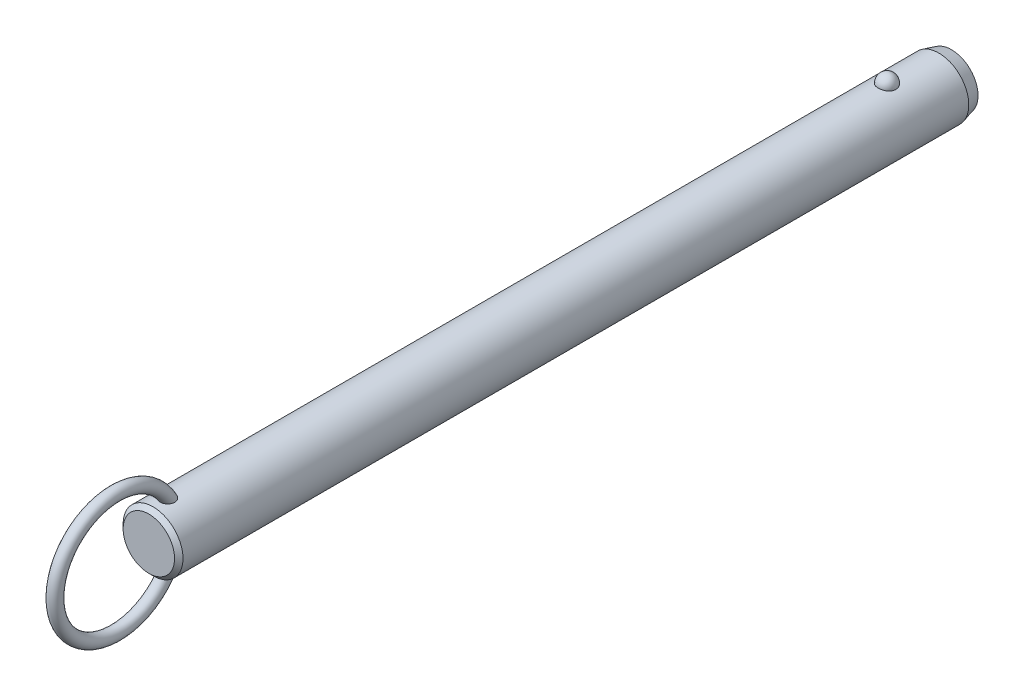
ISO-10303-21;
HEADER;
FILE_DESCRIPTION(('STEP AP214'),'2;1');
FILE_NAME('part.step','',(''),(''),'','','');
FILE_SCHEMA(('AUTOMOTIVE_DESIGN { 1 0 10303 214 1 1 1 1 }'));
ENDSEC;
DATA;
#1=APPLICATION_CONTEXT('core data for automotive mechanical design processes');
#2=APPLICATION_PROTOCOL_DEFINITION('international standard','automotive_design',2000,#1);
#3=PRODUCT_CONTEXT('',#1,'mechanical');
#4=PRODUCT('Part','Part','',(#3));
#5=PRODUCT_RELATED_PRODUCT_CATEGORY('part','',(#4));
#6=PRODUCT_DEFINITION_FORMATION('','',#4);
#7=PRODUCT_DEFINITION_CONTEXT('part definition',#1,'design');
#8=PRODUCT_DEFINITION('design','',#6,#7);
#9=PRODUCT_DEFINITION_SHAPE('','',#8);
#10=(LENGTH_UNIT() NAMED_UNIT(*) SI_UNIT(.MILLI.,.METRE.));
#11=(NAMED_UNIT(*) PLANE_ANGLE_UNIT() SI_UNIT($,.RADIAN.));
#12=(NAMED_UNIT(*) SI_UNIT($,.STERADIAN.) SOLID_ANGLE_UNIT());
#13=UNCERTAINTY_MEASURE_WITH_UNIT(LENGTH_MEASURE(1.E-05),#10,'distance_accuracy_value','');
#14=(GEOMETRIC_REPRESENTATION_CONTEXT(3) GLOBAL_UNCERTAINTY_ASSIGNED_CONTEXT((#13)) GLOBAL_UNIT_ASSIGNED_CONTEXT((#10,
#11,#12)) REPRESENTATION_CONTEXT('',''));
#15=CARTESIAN_POINT('',(0.,0.,0.));
#16=DIRECTION('',(0.,0.,1.));
#17=DIRECTION('',(1.,0.,0.));
#18=AXIS2_PLACEMENT_3D('',#15,#16,#17);
#19=CARTESIAN_POINT('',(0.,0.,165.1));
#20=DIRECTION('',(0.,0.,-1.));
#21=DIRECTION('',(-1.,0.,0.));
#22=AXIS2_PLACEMENT_3D('',#19,#20,#21);
#23=CYLINDRICAL_SURFACE('',#22,7.1);
#24=CARTESIAN_POINT('',(2.0769088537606,6.78943661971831,-2.1));
#25=CARTESIAN_POINT('',(2.07690739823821,6.78943796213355,-1.98268154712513));
#26=CARTESIAN_POINT('',(2.06738130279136,6.79237331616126,-1.86534506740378));
#27=CARTESIAN_POINT('',(2.0295040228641,6.8037853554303,-1.63400788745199));
#28=CARTESIAN_POINT('',(2.00114757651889,6.81226358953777,-1.52000812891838));
#29=CARTESIAN_POINT('',(1.92632025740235,6.83379798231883,-1.29863433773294));
#30=CARTESIAN_POINT('',(1.87985726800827,6.84685214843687,-1.19125744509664));
#31=CARTESIAN_POINT('',(1.76995205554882,6.87608091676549,-0.98604657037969));
#32=CARTESIAN_POINT('',(1.70650980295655,6.8922555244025,-0.88821260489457));
#33=CARTESIAN_POINT('',(1.5638119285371,6.92602930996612,-0.704242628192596));
#34=CARTESIAN_POINT('',(1.4844714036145,6.94363582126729,-0.618173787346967));
#35=CARTESIAN_POINT('',(1.31221746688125,6.97823658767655,-0.460740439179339));
#36=CARTESIAN_POINT('',(1.21930409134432,6.99523084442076,-0.389375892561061));
#37=CARTESIAN_POINT('',(1.02268781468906,7.02666176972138,-0.263547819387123));
#38=CARTESIAN_POINT('',(0.91902009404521,7.04110638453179,-0.209031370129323));
#39=CARTESIAN_POINT('',(0.703548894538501,7.06588726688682,-0.118163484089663));
#40=CARTESIAN_POINT('',(0.591746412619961,7.07622403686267,-0.0818098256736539));
#41=CARTESIAN_POINT('',(0.365557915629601,7.09147068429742,-0.0288711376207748));
#42=CARTESIAN_POINT('',(0.251267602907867,7.09648447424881,-0.0119070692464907));
#43=CARTESIAN_POINT('',(0.0213499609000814,7.10089837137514,0.00304925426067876));
#44=CARTESIAN_POINT('',(-0.0942772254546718,7.10029907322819,0.00104351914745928));
#45=CARTESIAN_POINT('',(-0.321651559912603,7.09360829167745,-0.0216931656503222));
#46=CARTESIAN_POINT('',(-0.433431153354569,7.08760388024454,-0.0421272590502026));
#47=CARTESIAN_POINT('',(-0.651862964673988,7.07086131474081,-0.100729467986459));
#48=CARTESIAN_POINT('',(-0.758515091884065,7.06012307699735,-0.138897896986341));
#49=CARTESIAN_POINT('',(-0.964449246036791,7.03496097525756,-0.232213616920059));
#50=CARTESIAN_POINT('',(-1.06368095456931,7.02051445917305,-0.287465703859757));
#51=CARTESIAN_POINT('',(-1.25145353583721,6.98948740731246,-0.413383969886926));
#52=CARTESIAN_POINT('',(-1.33999321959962,6.97290663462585,-0.48405186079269));
#53=CARTESIAN_POINT('',(-1.50591604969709,6.93898770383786,-0.640594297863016));
#54=CARTESIAN_POINT('',(-1.58302488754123,6.92164094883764,-0.726757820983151));
#55=CARTESIAN_POINT('',(-1.72189320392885,6.8884103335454,-0.91092752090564));
#56=CARTESIAN_POINT('',(-1.78365144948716,6.87252659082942,-1.008934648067));
#57=CARTESIAN_POINT('',(-1.89101272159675,6.84377189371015,-1.21549497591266));
#58=CARTESIAN_POINT('',(-1.93639553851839,6.83094274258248,-1.32416860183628));
#59=CARTESIAN_POINT('',(-2.00874275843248,6.81002070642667,-1.54791500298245));
#60=CARTESIAN_POINT('',(-2.03570774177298,6.80192767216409,-1.66298757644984));
#61=CARTESIAN_POINT('',(-2.07047276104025,6.7914266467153,-1.89571453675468));
#62=CARTESIAN_POINT('',(-2.07835878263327,6.78899315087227,-2.01335491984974));
#63=CARTESIAN_POINT('',(-2.07502083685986,6.79001409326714,-2.24833570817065));
#64=CARTESIAN_POINT('',(-2.06379746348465,6.7934683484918,-2.36567612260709));
#65=CARTESIAN_POINT('',(-2.02263913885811,6.80583442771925,-2.59603194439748));
#66=CARTESIAN_POINT('',(-1.99281127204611,6.81471501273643,-2.70906820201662));
#67=CARTESIAN_POINT('',(-1.91526639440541,6.83691232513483,-2.92836575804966));
#68=CARTESIAN_POINT('',(-1.8675486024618,6.85022924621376,-3.03462676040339));
#69=CARTESIAN_POINT('',(-1.75504492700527,6.87991336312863,-3.23806487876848));
#70=CARTESIAN_POINT('',(-1.69015924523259,6.89629822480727,-3.33518422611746));
#71=CARTESIAN_POINT('',(-1.54505404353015,6.93024852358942,-3.51697105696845));
#72=CARTESIAN_POINT('',(-1.46483385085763,6.94781401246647,-3.60163799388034));
#73=CARTESIAN_POINT('',(-1.29071406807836,6.98225977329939,-3.75654119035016));
#74=CARTESIAN_POINT('',(-1.19675650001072,6.99913673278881,-3.82671308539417));
#75=CARTESIAN_POINT('',(-0.997940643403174,7.03023618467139,-3.9501837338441));
#76=CARTESIAN_POINT('',(-0.89308318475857,7.04445887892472,-4.00348377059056));
#77=CARTESIAN_POINT('',(-0.676902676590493,7.06848365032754,-4.09107242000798));
#78=CARTESIAN_POINT('',(-0.565686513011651,7.0783430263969,-4.12560889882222));
#79=CARTESIAN_POINT('',(-0.338739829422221,7.09282534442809,-4.17575450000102));
#80=CARTESIAN_POINT('',(-0.223009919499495,7.09744899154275,-4.19136617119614));
#81=CARTESIAN_POINT('',(0.00707628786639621,7.10090930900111,-4.20307965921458));
#82=CARTESIAN_POINT('',(0.121410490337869,7.09986531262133,-4.19958377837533));
#83=CARTESIAN_POINT('',(0.347815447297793,7.092380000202,-4.17411564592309));
#84=CARTESIAN_POINT('',(0.459886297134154,7.08593891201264,-4.15214417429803));
#85=CARTESIAN_POINT('',(0.678084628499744,7.06838983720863,-4.09049562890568));
#86=CARTESIAN_POINT('',(0.784237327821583,7.05730369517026,-4.05090137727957));
#87=CARTESIAN_POINT('',(0.988305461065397,7.03163139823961,-3.95511447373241));
#88=CARTESIAN_POINT('',(1.08622031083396,7.01704499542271,-3.89892064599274));
#89=CARTESIAN_POINT('',(1.27284490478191,6.98562668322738,-3.77035541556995));
#90=CARTESIAN_POINT('',(1.36137372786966,6.96876135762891,-3.69772964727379));
#91=CARTESIAN_POINT('',(1.52509486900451,6.93477412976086,-3.53878279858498));
#92=CARTESIAN_POINT('',(1.60028496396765,6.91765218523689,-3.45245943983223));
#93=CARTESIAN_POINT('',(1.73681688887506,6.88465753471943,-3.26658774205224));
#94=CARTESIAN_POINT('',(1.79785966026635,6.86881574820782,-3.16681408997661));
#95=CARTESIAN_POINT('',(1.90265327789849,6.84053157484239,-2.95814408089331));
#96=CARTESIAN_POINT('',(1.94640861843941,6.82808830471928,-2.84925010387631));
#97=CARTESIAN_POINT('',(2.01274378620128,6.80881460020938,-2.63454318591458));
#98=CARTESIAN_POINT('',(2.03676193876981,6.80160856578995,-2.52920574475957));
#99=CARTESIAN_POINT('',(2.06884490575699,6.79191902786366,-2.3159172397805));
#100=CARTESIAN_POINT('',(2.07691019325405,6.78943538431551,-2.20796625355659));
#101=CARTESIAN_POINT('',(2.0769088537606,6.78943661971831,-2.1));
#102=B_SPLINE_CURVE_WITH_KNOTS('',3,(#24,#25,#26,#27,#28,#29,#30,#31,#32,#33,#34,#35,#36,#37,
#38,#39,#40,#41,#42,#43,#44,#45,#46,#47,#48,#49,#50,#51,#52,#53,#54,#55,#56,#57,#58,#59,#60,#61,
#62,#63,#64,#65,#66,#67,#68,#69,#70,#71,#72,#73,#74,#75,#76,#77,#78,#79,#80,#81,#82,#83,#84,#85,
#86,#87,#88,#89,#90,#91,#92,#93,#94,#95,#96,#97,#98,#99,#100,#101),.UNSPECIFIED.,.T.,.F.,(4,2,2,
2,2,2,2,2,2,2,2,2,2,2,2,2,2,2,2,2,2,2,2,2,2,2,2,2,2,2,2,2,2,2,2,2,2,2,4),(0.,0.351568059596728,
0.703234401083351,1.05474780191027,1.40626181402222,1.75970563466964,2.11314851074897,
2.4654696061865,2.81774759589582,3.16301449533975,3.50824481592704,3.84801136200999,
4.18778391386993,4.52968352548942,4.87162112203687,5.22076181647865,5.56993054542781,
5.92363364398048,6.27732559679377,6.62942052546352,6.98150450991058,7.33158042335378,
7.68167162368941,8.03384443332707,8.38603269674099,8.73975272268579,9.09344583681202,
9.44234545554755,9.79119807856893,10.1327344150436,10.4742563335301,10.8141898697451,
11.1541474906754,11.4997793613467,11.8454687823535,12.1979079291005,12.5502553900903,
12.8738073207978,13.1973496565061),.UNSPECIFIED.);
#103=CARTESIAN_POINT('',(2.0769088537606,6.78943661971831,-2.1));
#104=VERTEX_POINT('',#103);
#105=EDGE_CURVE('E41',#104,#104,#102,.T.);
#106=ORIENTED_EDGE('',*,*,#105,.T.);
#107=EDGE_LOOP('',(#106));
#108=FACE_BOUND('',#107,.T.);
#109=CARTESIAN_POINT('',(0.,0.,172.02));
#110=DIRECTION('',(0.,0.,1.));
#111=DIRECTION('',(1.,0.,0.));
#112=AXIS2_PLACEMENT_3D('',#109,#110,#111);
#113=CIRCLE('',#112,7.1);
#114=CARTESIAN_POINT('',(7.1,0.,172.02));
#115=VERTEX_POINT('',#114);
#116=EDGE_CURVE('E10',#115,#115,#113,.F.);
#117=ORIENTED_EDGE('',*,*,#116,.T.);
#118=EDGE_LOOP('',(#117));
#119=FACE_BOUND('',#118,.T.);
#120=CARTESIAN_POINT('',(-0.429539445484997,-7.08699541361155,166.842921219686));
#121=CARTESIAN_POINT('',(-0.508331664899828,-7.08221999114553,166.866876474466));
#122=CARTESIAN_POINT('',(-0.585039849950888,-7.07624016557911,166.897457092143));
#123=CARTESIAN_POINT('',(-0.73208265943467,-7.06254296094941,166.971024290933));
#124=CARTESIAN_POINT('',(-0.802417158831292,-7.05482554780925,167.014011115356));
#125=CARTESIAN_POINT('',(-0.934722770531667,-7.03851844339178,167.111113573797));
#126=CARTESIAN_POINT('',(-0.996700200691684,-7.02992941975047,167.165220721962));
#127=CARTESIAN_POINT('',(-1.11079942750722,-7.01280697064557,167.282967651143));
#128=CARTESIAN_POINT('',(-1.16292136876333,-7.00427354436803,167.346607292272));
#129=CARTESIAN_POINT('',(-1.25705660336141,-6.98799959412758,167.482687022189));
#130=CARTESIAN_POINT('',(-1.29888032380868,-6.98027525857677,167.555259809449));
#131=CARTESIAN_POINT('',(-1.37069920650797,-6.96652886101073,167.706168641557));
#132=CARTESIAN_POINT('',(-1.40069157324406,-6.96050720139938,167.784506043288));
#133=CARTESIAN_POINT('',(-1.45043507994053,-6.95031881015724,167.950190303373));
#134=CARTESIAN_POINT('',(-1.46937115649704,-6.94630231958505,168.037789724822));
#135=CARTESIAN_POINT('',(-1.49424917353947,-6.94099239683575,168.214871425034));
#136=CARTESIAN_POINT('',(-1.50018601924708,-6.93970003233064,168.304354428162));
#137=CARTESIAN_POINT('',(-1.49978214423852,-6.93978815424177,168.494060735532));
#138=CARTESIAN_POINT('',(-1.49187639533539,-6.94150934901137,168.594279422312));
#139=CARTESIAN_POINT('',(-1.46177925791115,-6.94790814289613,168.792479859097));
#140=CARTESIAN_POINT('',(-1.43957541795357,-6.95258831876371,168.890459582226));
#141=CARTESIAN_POINT('',(-1.37783293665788,-6.96510647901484,169.09536292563));
#142=CARTESIAN_POINT('',(-1.33634073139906,-6.97328848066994,169.201680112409));
#143=CARTESIAN_POINT('',(-1.23686994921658,-6.99161706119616,169.406177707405));
#144=CARTESIAN_POINT('',(-1.17889192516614,-7.00176357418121,169.504358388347));
#145=CARTESIAN_POINT('',(-1.05875124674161,-7.02082898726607,169.672374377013));
#146=CARTESIAN_POINT('',(-0.999247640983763,-7.02963746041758,169.744123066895));
#147=CARTESIAN_POINT('',(-0.869494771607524,-7.04686074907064,169.877195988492));
#148=CARTESIAN_POINT('',(-0.799263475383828,-7.05527619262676,169.938537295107));
#149=CARTESIAN_POINT('',(-0.665408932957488,-7.06899457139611,170.035131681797));
#150=CARTESIAN_POINT('',(-0.603817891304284,-7.07457275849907,170.073151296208));
#151=CARTESIAN_POINT('',(-0.475172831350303,-7.08437420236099,170.138758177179));
#152=CARTESIAN_POINT('',(-0.408123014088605,-7.08859848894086,170.166353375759));
#153=CARTESIAN_POINT('',(-0.269431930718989,-7.09522749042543,170.209256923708));
#154=CARTESIAN_POINT('',(-0.197757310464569,-7.09761688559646,170.224461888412));
#155=CARTESIAN_POINT('',(-0.0527849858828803,-7.10017268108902,170.240716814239));
#156=CARTESIAN_POINT('',(0.0205115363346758,-7.10034065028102,170.241776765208));
#157=CARTESIAN_POINT('',(0.156426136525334,-7.09855986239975,170.230461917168));
#158=CARTESIAN_POINT('',(0.219199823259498,-7.09688191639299,170.219806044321));
#159=CARTESIAN_POINT('',(0.342134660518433,-7.09201880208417,170.188537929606));
#160=CARTESIAN_POINT('',(0.402295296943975,-7.08883333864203,170.167923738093));
#161=CARTESIAN_POINT('',(0.520687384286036,-7.08113868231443,170.117212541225));
#162=CARTESIAN_POINT('',(0.578791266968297,-7.07658958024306,170.086827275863));
#163=CARTESIAN_POINT('',(0.690173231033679,-7.06659708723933,170.018367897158));
#164=CARTESIAN_POINT('',(0.743447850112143,-7.061153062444,169.980288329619));
#165=CARTESIAN_POINT('',(0.870947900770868,-7.04680292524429,169.876592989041));
#166=CARTESIAN_POINT('',(0.941828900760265,-7.03755800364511,169.806897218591));
#167=CARTESIAN_POINT('',(1.07136606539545,-7.01900793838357,169.656945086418));
#168=CARTESIAN_POINT('',(1.13000013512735,-7.00970271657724,169.576670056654));
#169=CARTESIAN_POINT('',(1.23579584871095,-6.99183327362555,169.406899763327));
#170=CARTESIAN_POINT('',(1.28274271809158,-6.98328455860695,169.317269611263));
#171=CARTESIAN_POINT('',(1.36351442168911,-6.96796352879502,169.132176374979));
#172=CARTESIAN_POINT('',(1.39733971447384,-6.96119115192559,169.036713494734));
#173=CARTESIAN_POINT('',(1.45579181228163,-6.94922464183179,168.82530928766));
#174=CARTESIAN_POINT('',(1.47790145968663,-6.94449000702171,168.708631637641));
#175=CARTESIAN_POINT('',(1.50168752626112,-6.93938731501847,168.473015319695));
#176=CARTESIAN_POINT('',(1.50336085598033,-6.93901991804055,168.35407631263));
#177=CARTESIAN_POINT('',(1.48486516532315,-6.9430010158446,168.12360799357));
#178=CARTESIAN_POINT('',(1.46573441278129,-6.9471253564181,168.011995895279));
#179=CARTESIAN_POINT('',(1.40606892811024,-6.95944667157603,167.794886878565));
#180=CARTESIAN_POINT('',(1.36556446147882,-6.96763788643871,167.6893815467));
#181=CARTESIAN_POINT('',(1.2708270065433,-6.98548038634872,167.504287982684));
#182=CARTESIAN_POINT('',(1.21949810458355,-6.99473841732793,167.423171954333));
#183=CARTESIAN_POINT('',(1.10242050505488,-7.01414069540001,167.272227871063));
#184=CARTESIAN_POINT('',(1.03668119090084,-7.02428436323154,167.20239252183));
#185=CARTESIAN_POINT('',(0.900559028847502,-7.04295285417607,167.083573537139));
#186=CARTESIAN_POINT('',(0.831428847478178,-7.05153466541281,167.033157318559));
#187=CARTESIAN_POINT('',(0.685291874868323,-7.06723150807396,166.945142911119));
#188=CARTESIAN_POINT('',(0.608287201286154,-7.07434693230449,166.907541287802));
#189=CARTESIAN_POINT('',(0.451878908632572,-7.08602232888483,166.847491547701));
#190=CARTESIAN_POINT('',(0.372686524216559,-7.09067127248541,166.824508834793));
#191=CARTESIAN_POINT('',(0.21147739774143,-7.09730788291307,166.792035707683));
#192=CARTESIAN_POINT('',(0.129460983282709,-7.09929585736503,166.78254373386));
#193=CARTESIAN_POINT('',(-0.0332905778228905,-7.10037858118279,166.777351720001));
#194=CARTESIAN_POINT('',(-0.114016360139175,-7.09953334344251,166.781365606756));
#195=CARTESIAN_POINT('',(-0.273670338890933,-7.09517338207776,166.802454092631));
#196=CARTESIAN_POINT('',(-0.352598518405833,-7.09165863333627,166.819528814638));
#197=CARTESIAN_POINT('',(-0.429539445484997,-7.08699541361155,166.842921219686));
#198=B_SPLINE_CURVE_WITH_KNOTS('',3,(#120,#121,#122,#123,#124,#125,#126,#127,#128,#129,#130,
#131,#132,#133,#134,#135,#136,#137,#138,#139,#140,#141,#142,#143,#144,#145,#146,#147,#148,#149,
#150,#151,#152,#153,#154,#155,#156,#157,#158,#159,#160,#161,#162,#163,#164,#165,#166,#167,#168,
#169,#170,#171,#172,#173,#174,#175,#176,#177,#178,#179,#180,#181,#182,#183,#184,#185,#186,#187,
#188,#189,#190,#191,#192,#193,#194,#195,#196,#197),.UNSPECIFIED.,.T.,.F.,(4,2,2,2,2,2,2,2,2,2,2,
2,2,2,2,2,2,2,2,2,2,2,2,2,2,2,2,2,2,2,2,2,2,2,2,2,2,2,4),(0.,0.247183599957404,
0.494372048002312,0.741372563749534,0.988369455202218,1.23962059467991,1.490931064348,
1.75897818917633,2.02713035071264,2.3275826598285,2.62829697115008,2.97008736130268,
3.31186629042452,3.59175319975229,3.87117637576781,4.08813841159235,4.30493502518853,
4.5235225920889,4.74195577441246,4.93215328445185,5.12238804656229,5.31884850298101,
5.51544871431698,5.81332317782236,6.11173048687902,6.41527266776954,6.71880423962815,
7.07358156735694,7.42841252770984,7.76631485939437,8.10373999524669,8.39142246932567,
8.67891817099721,8.93560332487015,9.19221962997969,9.43881106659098,9.68537399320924,
9.92674752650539,10.1681233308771),.UNSPECIFIED.);
#199=CARTESIAN_POINT('',(-0.429539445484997,-7.08699541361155,166.842921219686));
#200=VERTEX_POINT('',#199);
#201=EDGE_CURVE('E58',#200,#200,#198,.T.);
#202=ORIENTED_EDGE('',*,*,#201,.T.);
#203=EDGE_LOOP('',(#202));
#204=FACE_BOUND('',#203,.T.);
#205=CARTESIAN_POINT('',(-0.429539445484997,7.08699541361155,166.842921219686));
#206=CARTESIAN_POINT('',(-0.351665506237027,7.09171429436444,166.819246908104));
#207=CARTESIAN_POINT('',(-0.271733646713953,7.09525896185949,166.802036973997));
#208=CARTESIAN_POINT('',(-0.110026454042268,7.09960839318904,166.781005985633));
#209=CARTESIAN_POINT('',(-0.0282502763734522,7.10041187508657,166.777191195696));
#210=CARTESIAN_POINT('',(0.134782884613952,7.09918849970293,166.783059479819));
#211=CARTESIAN_POINT('',(0.216039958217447,7.09716214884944,166.79274013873));
#212=CARTESIAN_POINT('',(0.375730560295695,7.09050177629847,166.825347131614));
#213=CARTESIAN_POINT('',(0.454164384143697,7.08586802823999,166.848272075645));
#214=CARTESIAN_POINT('',(0.606025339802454,7.07449911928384,166.906771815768));
#215=CARTESIAN_POINT('',(0.67945100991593,7.06776334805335,166.942350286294));
#216=CARTESIAN_POINT('',(0.819234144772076,7.05292866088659,167.025175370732));
#217=CARTESIAN_POINT('',(0.88559181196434,7.04482978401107,167.072421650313));
#218=CARTESIAN_POINT('',(1.00993211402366,7.02808709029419,167.177590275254));
#219=CARTESIAN_POINT('',(1.06785399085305,7.01943990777,167.235583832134));
#220=CARTESIAN_POINT('',(1.17342527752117,7.00256662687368,167.360301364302));
#221=CARTESIAN_POINT('',(1.22107408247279,6.99434055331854,167.427025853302));
#222=CARTESIAN_POINT('',(1.30652927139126,6.97889183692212,167.569362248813));
#223=CARTESIAN_POINT('',(1.34399711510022,6.97170674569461,167.645180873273));
#224=CARTESIAN_POINT('',(1.40682616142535,6.95930080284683,167.801810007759));
#225=CARTESIAN_POINT('',(1.43218374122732,6.95408053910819,167.88262200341));
#226=CARTESIAN_POINT('',(1.47246409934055,6.94566853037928,168.053531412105));
#227=CARTESIAN_POINT('',(1.48642590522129,6.9426653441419,168.14386307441));
#228=CARTESIAN_POINT('',(1.5011410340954,6.93949744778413,168.325619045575));
#229=CARTESIAN_POINT('',(1.50188917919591,6.93933385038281,168.417043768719));
#230=CARTESIAN_POINT('',(1.49030464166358,6.94183245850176,168.61084381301));
#231=CARTESIAN_POINT('',(1.47627413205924,6.94486147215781,168.713112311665));
#232=CARTESIAN_POINT('',(1.43356351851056,6.95380194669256,168.914471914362));
#233=CARTESIAN_POINT('',(1.4048676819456,6.95971650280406,169.013559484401));
#234=CARTESIAN_POINT('',(1.32908750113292,6.97461208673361,169.218908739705));
#235=CARTESIAN_POINT('',(1.28011435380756,6.98388945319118,169.324456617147));
#236=CARTESIAN_POINT('',(1.16520357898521,7.00397743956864,169.525760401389));
#237=CARTESIAN_POINT('',(1.09927694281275,7.01478706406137,169.621522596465));
#238=CARTESIAN_POINT('',(0.969361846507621,7.03373936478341,169.776756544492));
#239=CARTESIAN_POINT('',(0.909042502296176,7.04187023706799,169.839303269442));
#240=CARTESIAN_POINT('',(0.779178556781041,7.05741732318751,169.954053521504));
#241=CARTESIAN_POINT('',(0.709649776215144,7.06483472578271,170.006274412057));
#242=CARTESIAN_POINT('',(0.576854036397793,7.0767751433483,170.088113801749));
#243=CARTESIAN_POINT('',(0.515118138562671,7.08158033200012,170.120164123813));
#244=CARTESIAN_POINT('',(0.387127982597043,7.08972701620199,170.173765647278));
#245=CARTESIAN_POINT('',(0.320877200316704,7.09306962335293,170.195324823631));
#246=CARTESIAN_POINT('',(0.185041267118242,7.09791507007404,170.226400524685));
#247=CARTESIAN_POINT('',(0.115437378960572,7.09940591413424,170.235838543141));
#248=CARTESIAN_POINT('',(-0.0243157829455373,7.10030171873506,170.241522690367));
#249=CARTESIAN_POINT('',(-0.0944648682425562,7.0997073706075,170.237773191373));
#250=CARTESIAN_POINT('',(-0.225713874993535,7.09668414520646,170.218508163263));
#251=CARTESIAN_POINT('',(-0.287006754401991,7.09444865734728,170.204232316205));
#252=CARTESIAN_POINT('',(-0.406555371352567,7.08860360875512,170.166368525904));
#253=CARTESIAN_POINT('',(-0.464809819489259,7.08499346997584,170.142776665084));
#254=CARTESIAN_POINT('',(-0.594955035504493,7.07541654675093,170.078923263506));
#255=CARTESIAN_POINT('',(-0.665389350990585,7.06906574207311,170.035753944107));
#256=CARTESIAN_POINT('',(-0.798242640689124,7.05530261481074,169.938587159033));
#257=CARTESIAN_POINT('',(-0.860645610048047,7.0478882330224,169.884568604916));
#258=CARTESIAN_POINT('',(-0.994249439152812,7.03045217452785,169.750996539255));
#259=CARTESIAN_POINT('',(-1.06260129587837,7.02030745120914,169.668614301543));
#260=CARTESIAN_POINT('',(-1.18502045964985,7.00068382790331,169.493843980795));
#261=CARTESIAN_POINT('',(-1.23907684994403,6.99120544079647,169.401448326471));
#262=CARTESIAN_POINT('',(-1.33335589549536,6.97384343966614,169.208008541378));
#263=CARTESIAN_POINT('',(-1.37336138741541,6.96598557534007,169.106856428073));
#264=CARTESIAN_POINT('',(-1.43770677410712,6.9529905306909,168.899504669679));
#265=CARTESIAN_POINT('',(-1.46204473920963,6.94785368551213,168.79330440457));
#266=CARTESIAN_POINT('',(-1.49537533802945,6.94076296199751,168.568231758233));
#267=CARTESIAN_POINT('',(-1.50273564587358,6.93914842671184,168.44909751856));
#268=CARTESIAN_POINT('',(-1.4954555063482,6.94072368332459,168.211470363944));
#269=CARTESIAN_POINT('',(-1.48082914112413,6.94391040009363,168.092977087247));
#270=CARTESIAN_POINT('',(-1.43076401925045,6.95438579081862,167.873432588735));
#271=CARTESIAN_POINT('',(-1.39762227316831,6.96121852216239,167.771841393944));
#272=CARTESIAN_POINT('',(-1.31211274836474,6.97783941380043,167.577351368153));
#273=CARTESIAN_POINT('',(-1.25976607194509,6.98762432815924,167.48444313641));
#274=CARTESIAN_POINT('',(-1.14583073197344,7.00713153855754,167.324160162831));
#275=CARTESIAN_POINT('',(-1.08665947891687,7.01665982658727,167.255035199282));
#276=CARTESIAN_POINT('',(-0.956606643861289,7.03556646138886,167.128878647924));
#277=CARTESIAN_POINT('',(-0.885737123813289,7.04494495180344,167.071834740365));
#278=CARTESIAN_POINT('',(-0.751558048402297,7.06035735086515,166.983100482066));
#279=CARTESIAN_POINT('',(-0.69012057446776,7.0666695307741,166.948593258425));
#280=CARTESIAN_POINT('',(-0.562815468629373,7.07794609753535,166.888750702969));
#281=CARTESIAN_POINT('',(-0.496948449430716,7.08291067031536,166.863414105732));
#282=CARTESIAN_POINT('',(-0.429539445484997,7.08699541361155,166.842921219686));
#283=B_SPLINE_CURVE_WITH_KNOTS('',3,(#205,#206,#207,#208,#209,#210,#211,#212,#213,#214,#215,
#216,#217,#218,#219,#220,#221,#222,#223,#224,#225,#226,#227,#228,#229,#230,#231,#232,#233,#234,
#235,#236,#237,#238,#239,#240,#241,#242,#243,#244,#245,#246,#247,#248,#249,#250,#251,#252,#253,
#254,#255,#256,#257,#258,#259,#260,#261,#262,#263,#264,#265,#266,#267,#268,#269,#270,#271,#272,
#273,#274,#275,#276,#277,#278,#279,#280,#281,#282),.UNSPECIFIED.,.T.,.F.,(4,2,2,2,2,2,2,2,2,2,2,
2,2,2,2,2,2,2,2,2,2,2,2,2,2,2,2,2,2,2,2,2,2,2,2,2,2,2,4),(0.,0.244335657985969,
0.488785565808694,0.733191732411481,0.977572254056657,1.2220237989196,1.46646834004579,
1.71259457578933,1.9587352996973,2.21226768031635,2.46587585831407,2.73913816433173,
3.01250754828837,3.32109936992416,3.63002293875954,3.9786351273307,4.32702187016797,
4.58793945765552,4.84841449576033,5.05676704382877,5.26496096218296,5.47449661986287,
5.68396281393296,5.87205447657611,6.06022532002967,6.30743751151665,6.55513496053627,
6.87602468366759,7.1971587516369,7.52305774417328,7.84899686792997,8.2051615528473,
8.56109821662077,8.88040084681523,9.19935367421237,9.47236282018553,9.74509220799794,
9.95662250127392,10.1681235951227),.UNSPECIFIED.);
#284=CARTESIAN_POINT('',(-0.429539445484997,7.08699541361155,166.842921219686));
#285=VERTEX_POINT('',#284);
#286=EDGE_CURVE('E66',#285,#285,#283,.T.);
#287=ORIENTED_EDGE('',*,*,#286,.T.);
#288=EDGE_LOOP('',(#287));
#289=FACE_BOUND('',#288,.T.);
#290=CARTESIAN_POINT('',(0.,0.,-14.4));
#291=DIRECTION('',(0.,0.,-1.));
#292=DIRECTION('',(-1.,0.,0.));
#293=AXIS2_PLACEMENT_3D('',#290,#291,#292);
#294=CIRCLE('',#293,7.1);
#295=CARTESIAN_POINT('',(-7.1,0.,-14.4));
#296=VERTEX_POINT('',#295);
#297=EDGE_CURVE('E55',#296,#296,#294,.F.);
#298=ORIENTED_EDGE('',*,*,#297,.T.);
#299=EDGE_LOOP('',(#298));
#300=FACE_BOUND('',#299,.T.);
#301=ADVANCED_FACE('F37',(#108,#119,#204,#289,#300),#23,.T.);
#302=CARTESIAN_POINT('',(0.,0.,-17.4));
#303=DIRECTION('',(0.,0.,-1.));
#304=DIRECTION('',(-1.,0.,0.));
#305=AXIS2_PLACEMENT_3D('',#302,#303,#304);
#306=PLANE('',#305);
#307=CARTESIAN_POINT('',(0.,0.,-17.4));
#308=DIRECTION('',(0.,0.,-1.));
#309=DIRECTION('',(-1.,0.,0.));
#310=AXIS2_PLACEMENT_3D('',#307,#308,#309);
#311=CIRCLE('',#310,6.29615242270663);
#312=CARTESIAN_POINT('',(-6.29615242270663,0.,-17.4));
#313=VERTEX_POINT('',#312);
#314=EDGE_CURVE('E65',#313,#313,#311,.T.);
#315=ORIENTED_EDGE('',*,*,#314,.T.);
#316=EDGE_LOOP('',(#315));
#317=FACE_BOUND('',#316,.T.);
#318=ADVANCED_FACE('F84',(#317),#306,.T.);
#319=CARTESIAN_POINT('',(0.,0.,-17.4));
#320=DIRECTION('',(0.,0.,1.));
#321=DIRECTION('',(1.,0.,0.));
#322=AXIS2_PLACEMENT_3D('',#319,#320,#321);
#323=CONICAL_SURFACE('',#322,6.29615242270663,0.261799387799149);
#324=ORIENTED_EDGE('',*,*,#297,.F.);
#325=EDGE_LOOP('',(#324));
#326=FACE_BOUND('',#325,.T.);
#327=ORIENTED_EDGE('',*,*,#314,.F.);
#328=EDGE_LOOP('',(#327));
#329=FACE_BOUND('',#328,.T.);
#330=ADVANCED_FACE('F82',(#326,#329),#323,.T.);
#331=CARTESIAN_POINT('',(0.,0.,173.02));
#332=DIRECTION('',(0.,0.,1.));
#333=DIRECTION('',(1.,0.,0.));
#334=AXIS2_PLACEMENT_3D('',#331,#332,#333);
#335=PLANE('',#334);
#336=CARTESIAN_POINT('',(0.,0.,173.02));
#337=DIRECTION('',(0.,0.,1.));
#338=DIRECTION('',(1.,0.,0.));
#339=AXIS2_PLACEMENT_3D('',#336,#337,#338);
#340=CIRCLE('',#339,6.09999999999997);
#341=CARTESIAN_POINT('',(6.09999999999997,0.,173.02));
#342=VERTEX_POINT('',#341);
#343=EDGE_CURVE('E50',#342,#342,#340,.T.);
#344=ORIENTED_EDGE('',*,*,#343,.T.);
#345=EDGE_LOOP('',(#344));
#346=FACE_BOUND('',#345,.T.);
#347=ADVANCED_FACE('F76',(#346),#335,.T.);
#348=CARTESIAN_POINT('',(0.,0.,180.95));
#349=DIRECTION('',(1.,0.,0.));
#350=DIRECTION('',(0.,0.,-1.));
#351=AXIS2_PLACEMENT_3D('',#348,#349,#350);
#352=TOROIDAL_SURFACE('',#351,14.35,1.5);
#353=ORIENTED_EDGE('',*,*,#286,.F.);
#354=EDGE_LOOP('',(#353));
#355=FACE_BOUND('',#354,.T.);
#356=ORIENTED_EDGE('',*,*,#201,.F.);
#357=EDGE_LOOP('',(#356));
#358=FACE_BOUND('',#357,.T.);
#359=ADVANCED_FACE('F72',(#355,#358),#352,.T.);
#360=CARTESIAN_POINT('',(0.,0.,173.02));
#361=DIRECTION('',(0.,0.,-1.));
#362=DIRECTION('',(-1.,0.,0.));
#363=AXIS2_PLACEMENT_3D('',#360,#361,#362);
#364=CONICAL_SURFACE('',#363,6.09999999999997,0.78539816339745);
#365=ORIENTED_EDGE('',*,*,#116,.F.);
#366=EDGE_LOOP('',(#365));
#367=FACE_BOUND('',#366,.T.);
#368=ORIENTED_EDGE('',*,*,#343,.F.);
#369=EDGE_LOOP('',(#368));
#370=FACE_BOUND('',#369,.T.);
#371=ADVANCED_FACE('F39',(#367,#370),#364,.T.);
#372=CARTESIAN_POINT('',(0.,7.1,-2.1));
#373=DIRECTION('',(0.,1.,0.));
#374=DIRECTION('',(0.,0.,1.));
#375=AXIS2_PLACEMENT_3D('',#372,#373,#374);
#376=SPHERICAL_SURFACE('',#375,2.10000000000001);
#377=ORIENTED_EDGE('',*,*,#105,.F.);
#378=EDGE_LOOP('',(#377));
#379=FACE_BOUND('',#378,.T.);
#380=ADVANCED_FACE('F78',(#379),#376,.T.);
#381=CLOSED_SHELL('',(#301,#318,#330,#347,#359,#371,#380));
#382=MANIFOLD_SOLID_BREP('B2',#381);
#383=ADVANCED_BREP_SHAPE_REPRESENTATION('',(#18,#382),#14);
#384=SHAPE_DEFINITION_REPRESENTATION(#9,#383);
ENDSEC;
END-ISO-10303-21;
